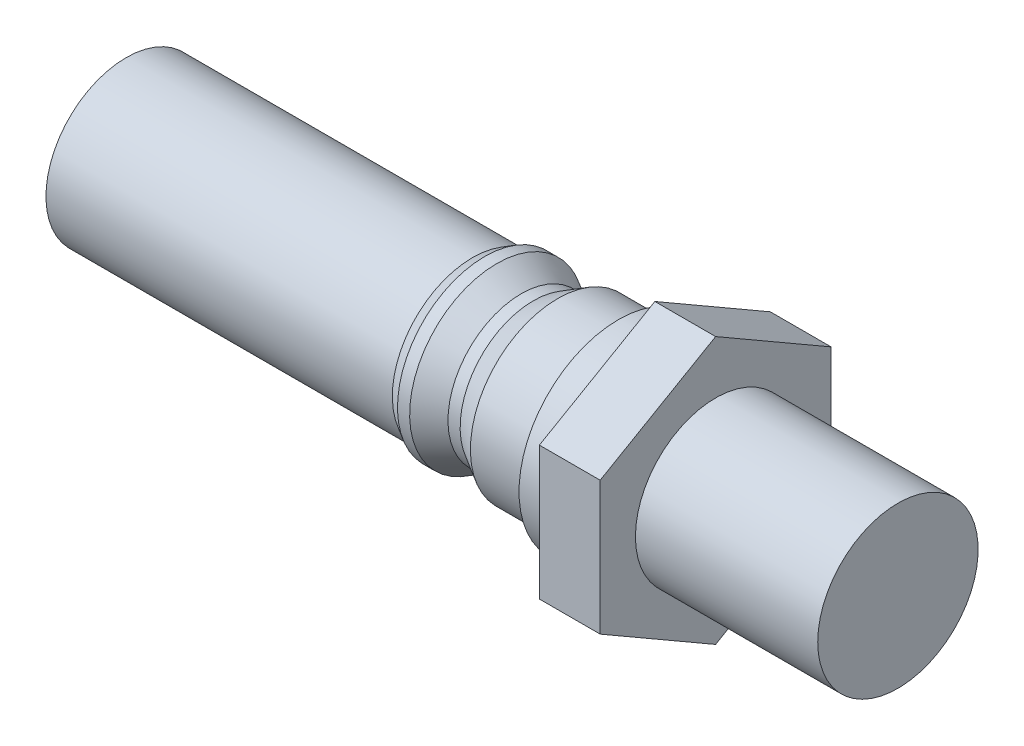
ISO-10303-21;
HEADER;
FILE_DESCRIPTION(('STEP AP214'),'2;1');
FILE_NAME('part.step','',(''),(''),'','','');
FILE_SCHEMA(('AUTOMOTIVE_DESIGN { 1 0 10303 214 1 1 1 1 }'));
ENDSEC;
DATA;
#1=APPLICATION_CONTEXT('core data for automotive mechanical design processes');
#2=APPLICATION_PROTOCOL_DEFINITION('international standard','automotive_design',2000,#1);
#3=PRODUCT_CONTEXT('',#1,'mechanical');
#4=PRODUCT('Part','Part','',(#3));
#5=PRODUCT_RELATED_PRODUCT_CATEGORY('part','',(#4));
#6=PRODUCT_DEFINITION_FORMATION('','',#4);
#7=PRODUCT_DEFINITION_CONTEXT('part definition',#1,'design');
#8=PRODUCT_DEFINITION('design','',#6,#7);
#9=PRODUCT_DEFINITION_SHAPE('','',#8);
#10=(LENGTH_UNIT() NAMED_UNIT(*) SI_UNIT(.MILLI.,.METRE.));
#11=(NAMED_UNIT(*) PLANE_ANGLE_UNIT() SI_UNIT($,.RADIAN.));
#12=(NAMED_UNIT(*) SI_UNIT($,.STERADIAN.) SOLID_ANGLE_UNIT());
#13=UNCERTAINTY_MEASURE_WITH_UNIT(LENGTH_MEASURE(1.E-05),#10,'distance_accuracy_value','');
#14=(GEOMETRIC_REPRESENTATION_CONTEXT(3) GLOBAL_UNCERTAINTY_ASSIGNED_CONTEXT((#13)) GLOBAL_UNIT_ASSIGNED_CONTEXT((#10,
#11,#12)) REPRESENTATION_CONTEXT('',''));
#15=CARTESIAN_POINT('',(0.,0.,0.));
#16=DIRECTION('',(0.,0.,1.));
#17=DIRECTION('',(1.,0.,0.));
#18=AXIS2_PLACEMENT_3D('',#15,#16,#17);
#19=CARTESIAN_POINT('',(0.,0.,0.));
#20=DIRECTION('',(-1.,0.,0.));
#21=DIRECTION('',(0.,-1.,0.));
#22=AXIS2_PLACEMENT_3D('',#19,#20,#21);
#23=PLANE('',#22);
#24=CARTESIAN_POINT('',(0.,0.,0.));
#25=DIRECTION('',(1.,0.,0.));
#26=DIRECTION('',(0.,1.,0.));
#27=AXIS2_PLACEMENT_3D('',#24,#25,#26);
#28=CIRCLE('',#27,6.6);
#29=CARTESIAN_POINT('',(0.,6.6,0.));
#30=VERTEX_POINT('',#29);
#31=EDGE_CURVE('E11',#30,#30,#28,.T.);
#32=ORIENTED_EDGE('',*,*,#31,.F.);
#33=EDGE_LOOP('',(#32));
#34=FACE_BOUND('',#33,.T.);
#35=ADVANCED_FACE('F33',(#34),#23,.T.);
#36=CARTESIAN_POINT('',(43.5,0.,0.));
#37=DIRECTION('',(1.,0.,0.));
#38=DIRECTION('',(0.,1.,0.));
#39=AXIS2_PLACEMENT_3D('',#36,#37,#38);
#40=CYLINDRICAL_SURFACE('',#39,6.6);
#41=ORIENTED_EDGE('',*,*,#31,.T.);
#42=EDGE_LOOP('',(#41));
#43=FACE_BOUND('',#42,.T.);
#44=CARTESIAN_POINT('',(28.5,0.,0.));
#45=DIRECTION('',(1.,0.,0.));
#46=DIRECTION('',(0.,1.,0.));
#47=AXIS2_PLACEMENT_3D('',#44,#45,#46);
#48=CIRCLE('',#47,6.6);
#49=CARTESIAN_POINT('',(28.5,6.6,0.));
#50=VERTEX_POINT('',#49);
#51=EDGE_CURVE('E41',#50,#50,#48,.T.);
#52=ORIENTED_EDGE('',*,*,#51,.F.);
#53=EDGE_LOOP('',(#52));
#54=FACE_BOUND('',#53,.T.);
#55=ADVANCED_FACE('F167',(#43,#54),#40,.T.);
#56=CARTESIAN_POINT('',(29.5,0.,0.));
#57=DIRECTION('',(1.,0.,0.));
#58=DIRECTION('',(0.,1.,0.));
#59=AXIS2_PLACEMENT_3D('',#56,#57,#58);
#60=CONICAL_SURFACE('',#59,7.17735026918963,0.5235987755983);
#61=ORIENTED_EDGE('',*,*,#51,.T.);
#62=EDGE_LOOP('',(#61));
#63=FACE_BOUND('',#62,.T.);
#64=CARTESIAN_POINT('',(29.5,0.,0.));
#65=DIRECTION('',(1.,0.,0.));
#66=DIRECTION('',(0.,1.,0.));
#67=AXIS2_PLACEMENT_3D('',#64,#65,#66);
#68=CIRCLE('',#67,7.17735026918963);
#69=CARTESIAN_POINT('',(29.5,7.17735026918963,0.));
#70=VERTEX_POINT('',#69);
#71=EDGE_CURVE('E159',#70,#70,#68,.T.);
#72=ORIENTED_EDGE('',*,*,#71,.F.);
#73=EDGE_LOOP('',(#72));
#74=FACE_BOUND('',#73,.T.);
#75=ADVANCED_FACE('F164',(#63,#74),#60,.T.);
#76=CARTESIAN_POINT('',(43.5,0.,0.));
#77=DIRECTION('',(1.,0.,0.));
#78=DIRECTION('',(0.,1.,0.));
#79=AXIS2_PLACEMENT_3D('',#76,#77,#78);
#80=CYLINDRICAL_SURFACE('',#79,7.17735026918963);
#81=ORIENTED_EDGE('',*,*,#71,.T.);
#82=EDGE_LOOP('',(#81));
#83=FACE_BOUND('',#82,.T.);
#84=CARTESIAN_POINT('',(30.5,0.,0.));
#85=DIRECTION('',(1.,0.,0.));
#86=DIRECTION('',(0.,1.,0.));
#87=AXIS2_PLACEMENT_3D('',#84,#85,#86);
#88=CIRCLE('',#87,7.17735026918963);
#89=CARTESIAN_POINT('',(30.5,7.17735026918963,0.));
#90=VERTEX_POINT('',#89);
#91=EDGE_CURVE('E156',#90,#90,#88,.T.);
#92=ORIENTED_EDGE('',*,*,#91,.F.);
#93=EDGE_LOOP('',(#92));
#94=FACE_BOUND('',#93,.T.);
#95=ADVANCED_FACE('F174',(#83,#94),#80,.T.);
#96=CARTESIAN_POINT('',(32.5,0.,0.));
#97=DIRECTION('',(-1.,0.,0.));
#98=DIRECTION('',(0.,-1.,0.));
#99=AXIS2_PLACEMENT_3D('',#96,#97,#98);
#100=CONICAL_SURFACE('',#99,6.02264973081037,0.523598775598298);
#101=ORIENTED_EDGE('',*,*,#91,.T.);
#102=EDGE_LOOP('',(#101));
#103=FACE_BOUND('',#102,.T.);
#104=CARTESIAN_POINT('',(32.5,0.,0.));
#105=DIRECTION('',(1.,0.,0.));
#106=DIRECTION('',(0.,1.,0.));
#107=AXIS2_PLACEMENT_3D('',#104,#105,#106);
#108=CIRCLE('',#107,6.02264973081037);
#109=CARTESIAN_POINT('',(32.5,6.02264973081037,0.));
#110=VERTEX_POINT('',#109);
#111=EDGE_CURVE('E153',#110,#110,#108,.T.);
#112=ORIENTED_EDGE('',*,*,#111,.F.);
#113=EDGE_LOOP('',(#112));
#114=FACE_BOUND('',#113,.T.);
#115=ADVANCED_FACE('F180',(#103,#114),#100,.T.);
#116=CARTESIAN_POINT('',(43.5,0.,0.));
#117=DIRECTION('',(1.,0.,0.));
#118=DIRECTION('',(0.,1.,0.));
#119=AXIS2_PLACEMENT_3D('',#116,#117,#118);
#120=CYLINDRICAL_SURFACE('',#119,6.02264973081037);
#121=ORIENTED_EDGE('',*,*,#111,.T.);
#122=EDGE_LOOP('',(#121));
#123=FACE_BOUND('',#122,.T.);
#124=CARTESIAN_POINT('',(33.5,0.,0.));
#125=DIRECTION('',(1.,0.,0.));
#126=DIRECTION('',(0.,1.,0.));
#127=AXIS2_PLACEMENT_3D('',#124,#125,#126);
#128=CIRCLE('',#127,6.02264973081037);
#129=CARTESIAN_POINT('',(33.5,6.02264973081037,0.));
#130=VERTEX_POINT('',#129);
#131=EDGE_CURVE('E150',#130,#130,#128,.T.);
#132=ORIENTED_EDGE('',*,*,#131,.F.);
#133=EDGE_LOOP('',(#132));
#134=FACE_BOUND('',#133,.T.);
#135=ADVANCED_FACE('F184',(#123,#134),#120,.T.);
#136=CARTESIAN_POINT('',(35.5,0.,0.));
#137=DIRECTION('',(1.,0.,0.));
#138=DIRECTION('',(0.,1.,0.));
#139=AXIS2_PLACEMENT_3D('',#136,#137,#138);
#140=CONICAL_SURFACE('',#139,7.17735026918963,0.523598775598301);
#141=ORIENTED_EDGE('',*,*,#131,.T.);
#142=EDGE_LOOP('',(#141));
#143=FACE_BOUND('',#142,.T.);
#144=CARTESIAN_POINT('',(35.5,0.,0.));
#145=DIRECTION('',(1.,0.,0.));
#146=DIRECTION('',(0.,1.,0.));
#147=AXIS2_PLACEMENT_3D('',#144,#145,#146);
#148=CIRCLE('',#147,7.17735026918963);
#149=CARTESIAN_POINT('',(35.5,7.17735026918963,0.));
#150=VERTEX_POINT('',#149);
#151=EDGE_CURVE('E147',#150,#150,#148,.T.);
#152=ORIENTED_EDGE('',*,*,#151,.F.);
#153=EDGE_LOOP('',(#152));
#154=FACE_BOUND('',#153,.T.);
#155=ADVANCED_FACE('F188',(#143,#154),#140,.T.);
#156=CARTESIAN_POINT('',(43.5,0.,0.));
#157=DIRECTION('',(1.,0.,0.));
#158=DIRECTION('',(0.,1.,0.));
#159=AXIS2_PLACEMENT_3D('',#156,#157,#158);
#160=CYLINDRICAL_SURFACE('',#159,7.17735026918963);
#161=ORIENTED_EDGE('',*,*,#151,.T.);
#162=EDGE_LOOP('',(#161));
#163=FACE_BOUND('',#162,.T.);
#164=CARTESIAN_POINT('',(40.5,0.,0.));
#165=DIRECTION('',(1.,0.,0.));
#166=DIRECTION('',(0.,1.,0.));
#167=AXIS2_PLACEMENT_3D('',#164,#165,#166);
#168=CIRCLE('',#167,7.17735026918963);
#169=CARTESIAN_POINT('',(40.5,7.17735026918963,0.));
#170=VERTEX_POINT('',#169);
#171=EDGE_CURVE('E144',#170,#170,#168,.T.);
#172=ORIENTED_EDGE('',*,*,#171,.F.);
#173=EDGE_LOOP('',(#172));
#174=FACE_BOUND('',#173,.T.);
#175=ADVANCED_FACE('F192',(#163,#174),#160,.T.);
#176=CARTESIAN_POINT('',(40.5,7.17735026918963,0.));
#177=DIRECTION('',(-1.,0.,0.));
#178=DIRECTION('',(0.,-1.,0.));
#179=AXIS2_PLACEMENT_3D('',#176,#177,#178);
#180=PLANE('',#179);
#181=ORIENTED_EDGE('',*,*,#171,.T.);
#182=EDGE_LOOP('',(#181));
#183=FACE_BOUND('',#182,.T.);
#184=CARTESIAN_POINT('',(40.5,0.,0.));
#185=DIRECTION('',(1.,0.,0.));
#186=DIRECTION('',(0.,1.,0.));
#187=AXIS2_PLACEMENT_3D('',#184,#185,#186);
#188=CIRCLE('',#187,8.17735026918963);
#189=CARTESIAN_POINT('',(40.5,8.17735026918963,0.));
#190=VERTEX_POINT('',#189);
#191=EDGE_CURVE('E141',#190,#190,#188,.T.);
#192=ORIENTED_EDGE('',*,*,#191,.F.);
#193=EDGE_LOOP('',(#192));
#194=FACE_BOUND('',#193,.T.);
#195=ADVANCED_FACE('F196',(#183,#194),#180,.T.);
#196=CARTESIAN_POINT('',(43.5,0.,0.));
#197=DIRECTION('',(1.,0.,0.));
#198=DIRECTION('',(0.,1.,0.));
#199=AXIS2_PLACEMENT_3D('',#196,#197,#198);
#200=CYLINDRICAL_SURFACE('',#199,8.17735026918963);
#201=ORIENTED_EDGE('',*,*,#191,.T.);
#202=EDGE_LOOP('',(#201));
#203=FACE_BOUND('',#202,.T.);
#204=CARTESIAN_POINT('',(43.5,0.,0.));
#205=DIRECTION('',(1.,0.,0.));
#206=DIRECTION('',(0.,1.,0.));
#207=AXIS2_PLACEMENT_3D('',#204,#205,#206);
#208=CIRCLE('',#207,8.17735026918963);
#209=CARTESIAN_POINT('',(43.5,8.17735026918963,0.));
#210=VERTEX_POINT('',#209);
#211=EDGE_CURVE('E138',#210,#210,#208,.T.);
#212=ORIENTED_EDGE('',*,*,#211,.F.);
#213=EDGE_LOOP('',(#212));
#214=FACE_BOUND('',#213,.T.);
#215=ADVANCED_FACE('F200',(#203,#214),#200,.T.);
#216=CARTESIAN_POINT('',(48.5,5.48482755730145,-9.5));
#217=DIRECTION('',(0.,-0.866025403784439,0.5));
#218=DIRECTION('',(0.,-0.5,-0.866025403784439));
#219=AXIS2_PLACEMENT_3D('',#216,#217,#218);
#220=PLANE('',#219);
#221=DIRECTION('',(0.,0.5,0.866025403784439));
#222=VECTOR('',#221,1.);
#223=CARTESIAN_POINT('',(43.5,5.48482755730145,-9.5));
#224=LINE('',#223,#222);
#225=CARTESIAN_POINT('',(43.5,5.48482755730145,-9.5));
#226=VERTEX_POINT('',#225);
#227=CARTESIAN_POINT('',(43.5,10.9696551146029,0.));
#228=VERTEX_POINT('',#227);
#229=EDGE_CURVE('E118',#226,#228,#224,.T.);
#230=ORIENTED_EDGE('',*,*,#229,.T.);
#231=DIRECTION('',(-1.,0.,0.));
#232=VECTOR('',#231,1.);
#233=CARTESIAN_POINT('',(48.5,10.9696551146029,0.));
#234=LINE('',#233,#232);
#235=CARTESIAN_POINT('',(48.5,10.9696551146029,0.));
#236=VERTEX_POINT('',#235);
#237=EDGE_CURVE('E136',#236,#228,#234,.T.);
#238=ORIENTED_EDGE('',*,*,#237,.F.);
#239=DIRECTION('',(0.,0.5,0.866025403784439));
#240=VECTOR('',#239,1.);
#241=CARTESIAN_POINT('',(48.5,5.48482755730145,-9.5));
#242=LINE('',#241,#240);
#243=CARTESIAN_POINT('',(48.5,5.48482755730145,-9.5));
#244=VERTEX_POINT('',#243);
#245=EDGE_CURVE('E129',#244,#236,#242,.T.);
#246=ORIENTED_EDGE('',*,*,#245,.F.);
#247=DIRECTION('',(-1.,0.,0.));
#248=VECTOR('',#247,1.);
#249=CARTESIAN_POINT('',(48.5,5.48482755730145,-9.5));
#250=LINE('',#249,#248);
#251=EDGE_CURVE('E114',#244,#226,#250,.T.);
#252=ORIENTED_EDGE('',*,*,#251,.T.);
#253=EDGE_LOOP('',(#230,#238,#246,#252));
#254=FACE_BOUND('',#253,.T.);
#255=ADVANCED_FACE('F204',(#254),#220,.F.);
#256=CARTESIAN_POINT('',(48.5,10.9696551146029,0.));
#257=DIRECTION('',(0.,-0.866025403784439,-0.5));
#258=DIRECTION('',(0.,0.5,-0.866025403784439));
#259=AXIS2_PLACEMENT_3D('',#256,#257,#258);
#260=PLANE('',#259);
#261=DIRECTION('',(0.,-0.5,0.866025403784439));
#262=VECTOR('',#261,1.);
#263=CARTESIAN_POINT('',(43.5,10.9696551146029,0.));
#264=LINE('',#263,#262);
#265=CARTESIAN_POINT('',(43.5,5.48482755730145,9.5));
#266=VERTEX_POINT('',#265);
#267=EDGE_CURVE('E121',#228,#266,#264,.T.);
#268=ORIENTED_EDGE('',*,*,#267,.T.);
#269=DIRECTION('',(-1.,0.,0.));
#270=VECTOR('',#269,1.);
#271=CARTESIAN_POINT('',(48.5,5.48482755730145,9.5));
#272=LINE('',#271,#270);
#273=CARTESIAN_POINT('',(48.5,5.48482755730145,9.5));
#274=VERTEX_POINT('',#273);
#275=EDGE_CURVE('E133',#274,#266,#272,.T.);
#276=ORIENTED_EDGE('',*,*,#275,.F.);
#277=DIRECTION('',(0.,-0.5,0.866025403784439));
#278=VECTOR('',#277,1.);
#279=CARTESIAN_POINT('',(48.5,10.9696551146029,0.));
#280=LINE('',#279,#278);
#281=EDGE_CURVE('E87',#236,#274,#280,.T.);
#282=ORIENTED_EDGE('',*,*,#281,.F.);
#283=ORIENTED_EDGE('',*,*,#237,.T.);
#284=EDGE_LOOP('',(#268,#276,#282,#283));
#285=FACE_BOUND('',#284,.T.);
#286=ADVANCED_FACE('F208',(#285),#260,.F.);
#287=CARTESIAN_POINT('',(48.5,5.48482755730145,9.5));
#288=DIRECTION('',(0.,0.,-1.));
#289=DIRECTION('',(-1.,0.,0.));
#290=AXIS2_PLACEMENT_3D('',#287,#288,#289);
#291=PLANE('',#290);
#292=DIRECTION('',(0.,-1.,0.));
#293=VECTOR('',#292,1.);
#294=CARTESIAN_POINT('',(43.5,5.48482755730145,9.5));
#295=LINE('',#294,#293);
#296=CARTESIAN_POINT('',(43.5,-5.48482755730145,9.5));
#297=VERTEX_POINT('',#296);
#298=EDGE_CURVE('E124',#266,#297,#295,.T.);
#299=ORIENTED_EDGE('',*,*,#298,.T.);
#300=DIRECTION('',(-1.,0.,0.));
#301=VECTOR('',#300,1.);
#302=CARTESIAN_POINT('',(48.5,-5.48482755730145,9.5));
#303=LINE('',#302,#301);
#304=CARTESIAN_POINT('',(48.5,-5.48482755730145,9.5));
#305=VERTEX_POINT('',#304);
#306=EDGE_CURVE('E109',#305,#297,#303,.T.);
#307=ORIENTED_EDGE('',*,*,#306,.F.);
#308=DIRECTION('',(0.,-1.,0.));
#309=VECTOR('',#308,1.);
#310=CARTESIAN_POINT('',(48.5,5.48482755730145,9.5));
#311=LINE('',#310,#309);
#312=EDGE_CURVE('E100',#274,#305,#311,.T.);
#313=ORIENTED_EDGE('',*,*,#312,.F.);
#314=ORIENTED_EDGE('',*,*,#275,.T.);
#315=EDGE_LOOP('',(#299,#307,#313,#314));
#316=FACE_BOUND('',#315,.T.);
#317=ADVANCED_FACE('F212',(#316),#291,.F.);
#318=CARTESIAN_POINT('',(48.5,-5.48482755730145,9.5));
#319=DIRECTION('',(0.,0.866025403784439,-0.5));
#320=DIRECTION('',(0.,0.5,0.866025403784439));
#321=AXIS2_PLACEMENT_3D('',#318,#319,#320);
#322=PLANE('',#321);
#323=DIRECTION('',(0.,-0.5,-0.866025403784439));
#324=VECTOR('',#323,1.);
#325=CARTESIAN_POINT('',(43.5,-5.48482755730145,9.5));
#326=LINE('',#325,#324);
#327=CARTESIAN_POINT('',(43.5,-10.9696551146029,0.));
#328=VERTEX_POINT('',#327);
#329=EDGE_CURVE('E108',#297,#328,#326,.T.);
#330=ORIENTED_EDGE('',*,*,#329,.T.);
#331=DIRECTION('',(-1.,0.,0.));
#332=VECTOR('',#331,1.);
#333=CARTESIAN_POINT('',(48.5,-10.9696551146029,0.));
#334=LINE('',#333,#332);
#335=CARTESIAN_POINT('',(48.5,-10.9696551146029,0.));
#336=VERTEX_POINT('',#335);
#337=EDGE_CURVE('E105',#336,#328,#334,.T.);
#338=ORIENTED_EDGE('',*,*,#337,.F.);
#339=DIRECTION('',(0.,-0.5,-0.866025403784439));
#340=VECTOR('',#339,1.);
#341=CARTESIAN_POINT('',(48.5,-5.48482755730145,9.5));
#342=LINE('',#341,#340);
#343=EDGE_CURVE('E94',#305,#336,#342,.T.);
#344=ORIENTED_EDGE('',*,*,#343,.F.);
#345=ORIENTED_EDGE('',*,*,#306,.T.);
#346=EDGE_LOOP('',(#330,#338,#344,#345));
#347=FACE_BOUND('',#346,.T.);
#348=ADVANCED_FACE('F106',(#347),#322,.F.);
#349=CARTESIAN_POINT('',(48.5,-10.9696551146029,0.));
#350=DIRECTION('',(0.,0.866025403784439,0.5));
#351=DIRECTION('',(0.,-0.5,0.866025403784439));
#352=AXIS2_PLACEMENT_3D('',#349,#350,#351);
#353=PLANE('',#352);
#354=DIRECTION('',(0.,0.5,-0.866025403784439));
#355=VECTOR('',#354,1.);
#356=CARTESIAN_POINT('',(43.5,-10.9696551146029,0.));
#357=LINE('',#356,#355);
#358=CARTESIAN_POINT('',(43.5,-5.48482755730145,-9.5));
#359=VERTEX_POINT('',#358);
#360=EDGE_CURVE('E72',#328,#359,#357,.T.);
#361=ORIENTED_EDGE('',*,*,#360,.T.);
#362=DIRECTION('',(-1.,0.,0.));
#363=VECTOR('',#362,1.);
#364=CARTESIAN_POINT('',(48.5,-5.48482755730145,-9.5));
#365=LINE('',#364,#363);
#366=CARTESIAN_POINT('',(48.5,-5.48482755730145,-9.5));
#367=VERTEX_POINT('',#366);
#368=EDGE_CURVE('E110',#367,#359,#365,.T.);
#369=ORIENTED_EDGE('',*,*,#368,.F.);
#370=DIRECTION('',(0.,0.5,-0.866025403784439));
#371=VECTOR('',#370,1.);
#372=CARTESIAN_POINT('',(48.5,-10.9696551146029,0.));
#373=LINE('',#372,#371);
#374=EDGE_CURVE('E98',#336,#367,#373,.T.);
#375=ORIENTED_EDGE('',*,*,#374,.F.);
#376=ORIENTED_EDGE('',*,*,#337,.T.);
#377=EDGE_LOOP('',(#361,#369,#375,#376));
#378=FACE_BOUND('',#377,.T.);
#379=ADVANCED_FACE('F112',(#378),#353,.F.);
#380=CARTESIAN_POINT('',(48.5,-5.48482755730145,-9.5));
#381=DIRECTION('',(0.,0.,1.));
#382=DIRECTION('',(1.,0.,0.));
#383=AXIS2_PLACEMENT_3D('',#380,#381,#382);
#384=PLANE('',#383);
#385=DIRECTION('',(0.,1.,0.));
#386=VECTOR('',#385,1.);
#387=CARTESIAN_POINT('',(43.5,-5.48482755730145,-9.5));
#388=LINE('',#387,#386);
#389=EDGE_CURVE('E78',#359,#226,#388,.T.);
#390=ORIENTED_EDGE('',*,*,#389,.T.);
#391=ORIENTED_EDGE('',*,*,#251,.F.);
#392=DIRECTION('',(0.,1.,0.));
#393=VECTOR('',#392,1.);
#394=CARTESIAN_POINT('',(48.5,-5.48482755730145,-9.5));
#395=LINE('',#394,#393);
#396=EDGE_CURVE('E49',#367,#244,#395,.T.);
#397=ORIENTED_EDGE('',*,*,#396,.F.);
#398=ORIENTED_EDGE('',*,*,#368,.T.);
#399=EDGE_LOOP('',(#390,#391,#397,#398));
#400=FACE_BOUND('',#399,.T.);
#401=ADVANCED_FACE('F220',(#400),#384,.F.);
#402=CARTESIAN_POINT('',(48.5,0.,0.));
#403=DIRECTION('',(1.,0.,0.));
#404=DIRECTION('',(0.,0.,-1.));
#405=AXIS2_PLACEMENT_3D('',#402,#403,#404);
#406=PLANE('',#405);
#407=CARTESIAN_POINT('',(48.5,0.,0.));
#408=DIRECTION('',(-1.,0.,0.));
#409=DIRECTION('',(0.,0.,1.));
#410=AXIS2_PLACEMENT_3D('',#407,#408,#409);
#411=CIRCLE('',#410,6.6);
#412=CARTESIAN_POINT('',(48.5,0.,6.6));
#413=VERTEX_POINT('',#412);
#414=EDGE_CURVE('E122',#413,#413,#411,.T.);
#415=ORIENTED_EDGE('',*,*,#414,.T.);
#416=EDGE_LOOP('',(#415));
#417=FACE_BOUND('',#416,.T.);
#418=ORIENTED_EDGE('',*,*,#245,.T.);
#419=ORIENTED_EDGE('',*,*,#281,.T.);
#420=ORIENTED_EDGE('',*,*,#312,.T.);
#421=ORIENTED_EDGE('',*,*,#343,.T.);
#422=ORIENTED_EDGE('',*,*,#374,.T.);
#423=ORIENTED_EDGE('',*,*,#396,.T.);
#424=EDGE_LOOP('',(#418,#419,#420,#421,#422,#423));
#425=FACE_BOUND('',#424,.T.);
#426=ADVANCED_FACE('F96',(#417,#425),#406,.T.);
#427=CARTESIAN_POINT('',(43.5,0.,0.));
#428=DIRECTION('',(1.,0.,0.));
#429=DIRECTION('',(0.,0.,-1.));
#430=AXIS2_PLACEMENT_3D('',#427,#428,#429);
#431=PLANE('',#430);
#432=ORIENTED_EDGE('',*,*,#211,.T.);
#433=EDGE_LOOP('',(#432));
#434=FACE_BOUND('',#433,.T.);
#435=ORIENTED_EDGE('',*,*,#229,.F.);
#436=ORIENTED_EDGE('',*,*,#389,.F.);
#437=ORIENTED_EDGE('',*,*,#360,.F.);
#438=ORIENTED_EDGE('',*,*,#329,.F.);
#439=ORIENTED_EDGE('',*,*,#298,.F.);
#440=ORIENTED_EDGE('',*,*,#267,.F.);
#441=EDGE_LOOP('',(#435,#436,#437,#438,#439,#440));
#442=FACE_BOUND('',#441,.T.);
#443=ADVANCED_FACE('F223',(#434,#442),#431,.F.);
#444=CARTESIAN_POINT('',(48.5,0.,0.));
#445=DIRECTION('',(-1.,0.,0.));
#446=DIRECTION('',(0.,0.,1.));
#447=AXIS2_PLACEMENT_3D('',#444,#445,#446);
#448=CYLINDRICAL_SURFACE('',#447,6.6);
#449=ORIENTED_EDGE('',*,*,#414,.F.);
#450=EDGE_LOOP('',(#449));
#451=FACE_BOUND('',#450,.T.);
#452=CARTESIAN_POINT('',(63.5,0.,0.));
#453=DIRECTION('',(-1.,0.,0.));
#454=DIRECTION('',(0.,0.,1.));
#455=AXIS2_PLACEMENT_3D('',#452,#453,#454);
#456=CIRCLE('',#455,6.6);
#457=CARTESIAN_POINT('',(63.5,0.,6.6));
#458=VERTEX_POINT('',#457);
#459=EDGE_CURVE('E241',#458,#458,#456,.T.);
#460=ORIENTED_EDGE('',*,*,#459,.T.);
#461=EDGE_LOOP('',(#460));
#462=FACE_BOUND('',#461,.T.);
#463=ADVANCED_FACE('F226',(#451,#462),#448,.T.);
#464=CARTESIAN_POINT('',(63.5,6.6,0.));
#465=DIRECTION('',(-1.,0.,0.));
#466=DIRECTION('',(0.,0.,1.));
#467=AXIS2_PLACEMENT_3D('',#464,#465,#466);
#468=PLANE('',#467);
#469=ORIENTED_EDGE('',*,*,#459,.F.);
#470=EDGE_LOOP('',(#469));
#471=FACE_BOUND('',#470,.T.);
#472=ADVANCED_FACE('F233',(#471),#468,.F.);
#473=CLOSED_SHELL('',(#35,#55,#75,#95,#115,#135,#155,#175,#195,#215,#255,#286,#317,#348,#379,
#401,#426,#443,#463,#472));
#474=MANIFOLD_SOLID_BREP('B2',#473);
#475=ADVANCED_BREP_SHAPE_REPRESENTATION('',(#18,#474),#14);
#476=SHAPE_DEFINITION_REPRESENTATION(#9,#475);
ENDSEC;
END-ISO-10303-21;
